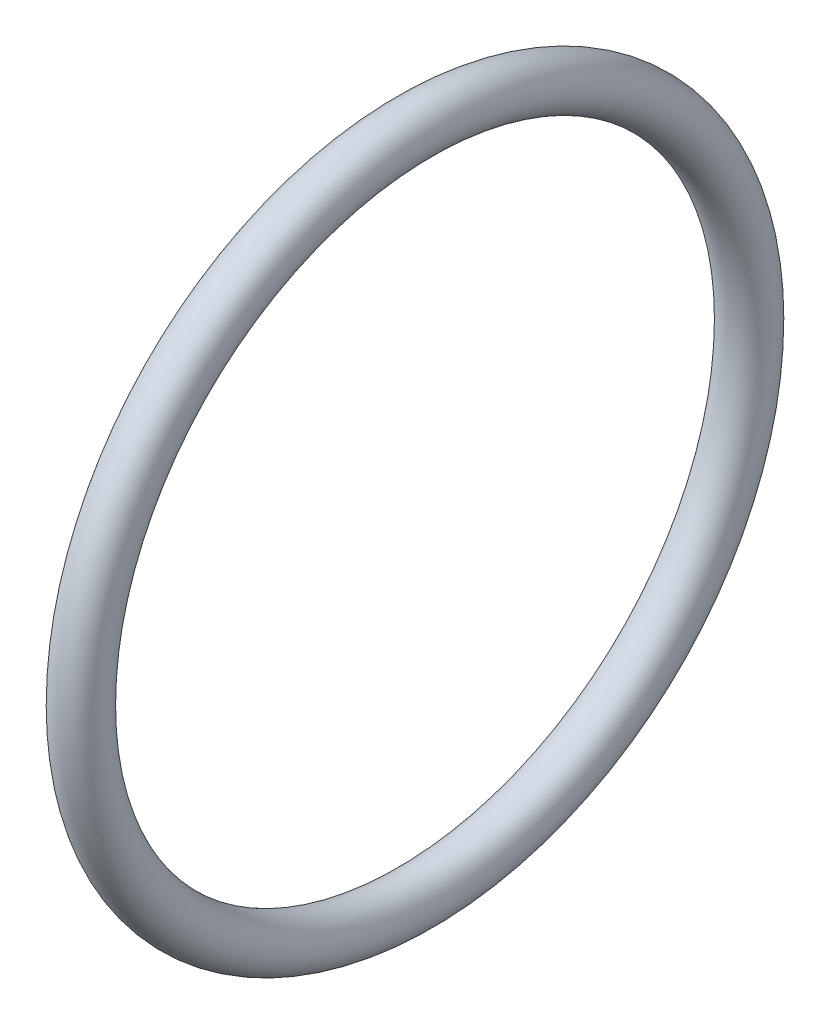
ISO-10303-21;
HEADER;
FILE_DESCRIPTION(('STEP AP214'),'2;1');
FILE_NAME('part.step','',(''),(''),'','','');
FILE_SCHEMA(('AUTOMOTIVE_DESIGN { 1 0 10303 214 1 1 1 1 }'));
ENDSEC;
DATA;
#1=APPLICATION_CONTEXT('core data for automotive mechanical design processes');
#2=APPLICATION_PROTOCOL_DEFINITION('international standard','automotive_design',2000,#1);
#3=PRODUCT_CONTEXT('',#1,'mechanical');
#4=PRODUCT('Part','Part','',(#3));
#5=PRODUCT_RELATED_PRODUCT_CATEGORY('part','',(#4));
#6=PRODUCT_DEFINITION_FORMATION('','',#4);
#7=PRODUCT_DEFINITION_CONTEXT('part definition',#1,'design');
#8=PRODUCT_DEFINITION('design','',#6,#7);
#9=PRODUCT_DEFINITION_SHAPE('','',#8);
#10=(LENGTH_UNIT() NAMED_UNIT(*) SI_UNIT(.MILLI.,.METRE.));
#11=(NAMED_UNIT(*) PLANE_ANGLE_UNIT() SI_UNIT($,.RADIAN.));
#12=(NAMED_UNIT(*) SI_UNIT($,.STERADIAN.) SOLID_ANGLE_UNIT());
#13=UNCERTAINTY_MEASURE_WITH_UNIT(LENGTH_MEASURE(1.E-05),#10,'distance_accuracy_value','');
#14=(GEOMETRIC_REPRESENTATION_CONTEXT(3) GLOBAL_UNCERTAINTY_ASSIGNED_CONTEXT((#13)) GLOBAL_UNIT_ASSIGNED_CONTEXT((#10,
#11,#12)) REPRESENTATION_CONTEXT('',''));
#15=CARTESIAN_POINT('',(0.,0.,0.));
#16=DIRECTION('',(0.,0.,1.));
#17=DIRECTION('',(1.,0.,0.));
#18=AXIS2_PLACEMENT_3D('',#15,#16,#17);
#19=CARTESIAN_POINT('',(3.99680288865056E-12,0.,0.));
#20=DIRECTION('',(-1.,0.,0.));
#21=DIRECTION('',(0.,0.,1.));
#22=AXIS2_PLACEMENT_3D('',#19,#20,#21);
#23=TOROIDAL_SURFACE('',#22,17.8054,1.3081);
#24=CARTESIAN_POINT('',(3.99673657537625E-12,0.,19.1135));
#25=VERTEX_POINT('',#24);
#26=VERTEX_LOOP('',#25);
#27=FACE_BOUND('',#26,.T.);
#28=ADVANCED_FACE('F28',(#27),#23,.T.);
#29=CLOSED_SHELL('',(#28));
#30=MANIFOLD_SOLID_BREP('B2',#29);
#31=ADVANCED_BREP_SHAPE_REPRESENTATION('',(#18,#30),#14);
#32=SHAPE_DEFINITION_REPRESENTATION(#9,#31);
ENDSEC;
END-ISO-10303-21;
